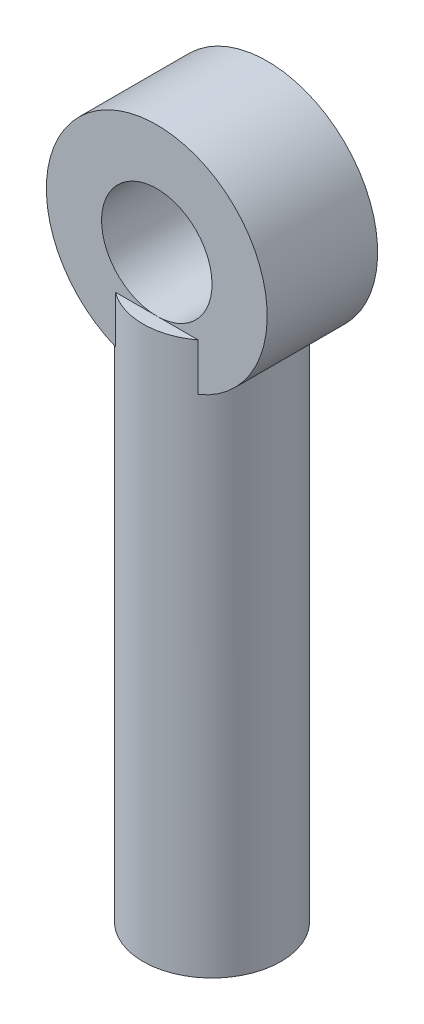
from build123d import *

# Parameters (mm, degrees)
SKETCH1_R      = 1.5875
EXTRUDE1_DEPTH = 12.7
SKETCH2_R      = 2.54
SKETCH2_R_2    = 1.27
EXTRUDE2_DEPTH = 1.27


with BuildPart() as part:
    # Sketch1 → Extrude1 (new body)
    with BuildSketch(Plane(origin=(0, 0, 0), x_dir=(1, 0, 0), z_dir=(0, 1, 0))):
        with Locations(Location((0, 0, 0), (0, 0, 270))):
            Circle(SKETCH1_R)
    extrude(amount=EXTRUDE1_DEPTH)

    # Sketch2 → Extrude2 (add, symmetric)
    with BuildSketch(Plane.XY):
        with Locations((0, 13.97)):
            Circle(SKETCH2_R)
        with Locations(Location((0, 13.97, 0), (0, 0, 270))):
            Circle(SKETCH2_R_2, mode=Mode.SUBTRACT)
    extrude(amount=EXTRUDE2_DEPTH, both=True)


solid = part.part
